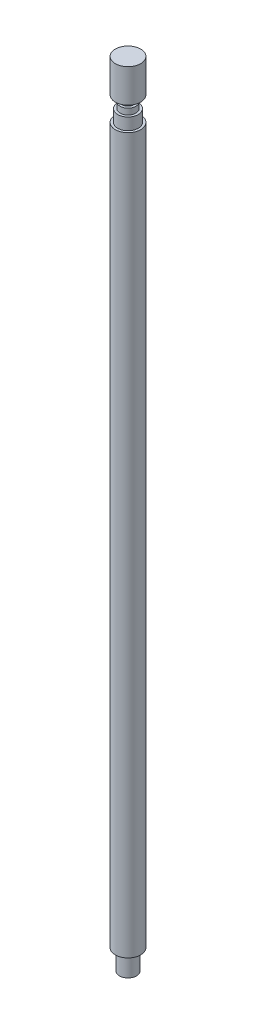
from build123d import *

# Parameters (mm, degrees)
ESQUISSE1_R      = 2.125
EXTRUSION1_DEPTH = 120
ESQUISSE2_R      = 1.725
EXTRUSION2_DEPTH = 2
ESQUISSE3_R      = 1.325
EXTRUSION3_DEPTH = 1
ESQUISSE4_R      = 0.925
EXTRUSION4_DEPTH = 6.6
EXTRUSION5_START = -5.6
ESQUISSE5_R      = 2.125
EXTRUSION5_DEPTH = 5.6
ESQUISSE6_R      = 1.435
EXTRUSION6_DEPTH = 3.4


with BuildPart() as part:
    # Esquisse1 → Extrusion1 (new body)
    with BuildSketch(Plane(origin=(0, 0, 0), x_dir=(1, 0, 0), z_dir=(0, 1, 0))):
        with Locations(Location((0, 0, 0), (0, 0, 270))):
            Circle(ESQUISSE1_R)
    extrude(amount=EXTRUSION1_DEPTH)

    # Esquisse2 → Extrusion2 (add)
    with BuildSketch(Plane(origin=(0, 120, 0), x_dir=(-1, 0, 0), z_dir=(0, 1, 0))):
        with Locations(Location((0, 0, 0), (0, 0, 90))):
            Circle(ESQUISSE2_R)
    extrude(amount=EXTRUSION2_DEPTH)

    # Esquisse3 → Extrusion3 (add)
    with BuildSketch(Plane(origin=(0, 122, 0), x_dir=(-1, 0, 0), z_dir=(0, 1, 0))):
        with Locations(Location((0, 0, 0), (0, 0, 90))):
            Circle(ESQUISSE3_R)
    extrude(amount=EXTRUSION3_DEPTH)

    # Esquisse4 → Extrusion4 (add)
    with BuildSketch(Plane(origin=(0, 123, 0), x_dir=(-1, 0, 0), z_dir=(0, 1, 0))):
        with Locations(Location((0, 0, 0), (0, 0, 90))):
            Circle(ESQUISSE4_R)
    extrude(amount=EXTRUSION4_DEPTH)

    # Esquisse5 → Extrusion5 (add)
    with BuildSketch(Plane(origin=(0, 129.6, 0), x_dir=(-1, 0, 0), z_dir=(0, 1, 0)).offset(EXTRUSION5_START)):
        with Locations(Location((0, 0, 0), (0, 0, 90))):
            Circle(ESQUISSE5_R)
    extrude(amount=EXTRUSION5_DEPTH)

    # Esquisse6 → Extrusion6 (add)
    with BuildSketch(Plane.XZ):
        with Locations(Location((0, 0, 0), (0, 0, 90))):
            Circle(ESQUISSE6_R)
    extrude(amount=EXTRUSION6_DEPTH)


solid = part.part
